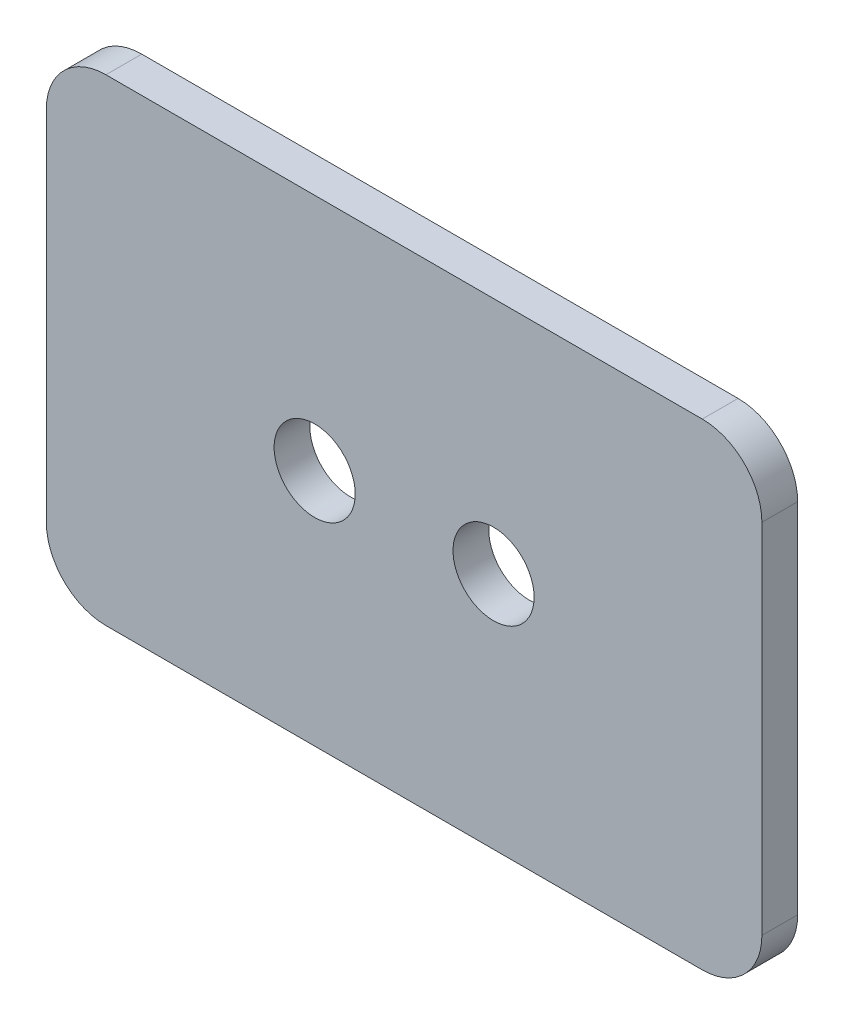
from build123d import *

# Parameters (mm, degrees)
ESQUISSE1_W      = 60
ESQUISSE1_H      = 40
EXTRUSION1_DEPTH = 3
ESQUISSE2_R      = 3.4
EXTRUSION2_DEPTH = 4
CONG_1_R         = 5


with BuildPart() as part:
    # Esquisse1 → Extrusion1 (new body)
    with BuildSketch(Plane.XY):
        with Locations((30, 20)):
            Rectangle(ESQUISSE1_W, ESQUISSE1_H)
    extrude(amount=EXTRUSION1_DEPTH)

    # Esquisse2 → Extrusion2 (cut)
    with BuildSketch(Plane.XY.offset(3)):
        with Locations((22.5, 20)):
            Circle(ESQUISSE2_R)
        with Locations((37.5, 20)):
            Circle(ESQUISSE2_R)
    extrude(amount=-EXTRUSION2_DEPTH, mode=Mode.SUBTRACT)

    # Cong_1
    cong_1_edges = [part.edges().sort_by_distance(p)[0] for p in [
        (0, 40, 1.5),
        (60, 40, 1.5),
        (60, 0, 1.5),
        (0, 0, 1.5),
    ]]
    fillet(cong_1_edges, radius=CONG_1_R)


solid = part.part
